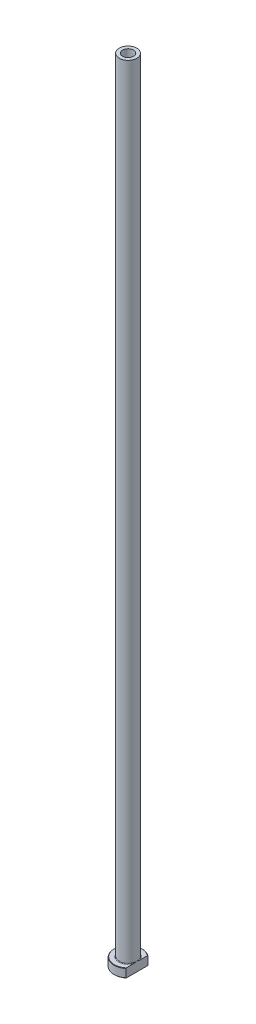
from build123d import *

# Parameters (mm, degrees)
FILLET1_R          = 0.3
CHAMFER1_SIZE      = 0.2
CUT_EXTRUDE1_DEPTH = 451.142199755
CHAMFER2_SIZE      = 0.5


with BuildPart() as part:
    # Sketch1 → Revolve1 (revolve)
    with BuildSketch(Plane.XY, mode=Mode.PRIVATE) as revolve1_sk:
        Polygon((-3.1, 450), (-5, 450), (-5, 5), (-8, 5), (-8, 0), (-3.35, 0), (-3.35, 393), (-3.1, 405), align=None)
    revolve(revolve1_sk.sketch.rotate(Axis((0, 92.187680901, 0), (0, -1, 0)), 270), axis=Axis((0, 92.187680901, 0), (0, -1, 0)))

    # Fillet1
    fillet1_edges = [part.edges().sort_by_distance(p)[0] for p in [
        (0, 5, -5),
    ]]
    fillet(fillet1_edges, radius=FILLET1_R)

    # Chamfer1
    chamfer1_edges = [part.edges().sort_by_distance(p)[0] for p in [
        (0, 0, -8),
        (0, 5, -8),
    ]]
    chamfer(chamfer1_edges, length=CHAMFER1_SIZE)

    # Sketch2 → Cut-Extrude1 (cut, through all)
    with BuildSketch(Plane.XZ):
        with BuildLine():
            Line((5, 6.244997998), (5, -6.244997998))
            ThreePointArc((5, -6.244997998), (8, 0), (5, 6.244997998))
        make_face()
    extrude(amount=-CUT_EXTRUDE1_DEPTH, mode=Mode.SUBTRACT)

    # Chamfer2
    chamfer2_edges = [part.edges().sort_by_distance(p)[0] for p in [
        (0, 0, -3.35),
    ]]
    chamfer(chamfer2_edges, length=CHAMFER2_SIZE)


solid = part.part
